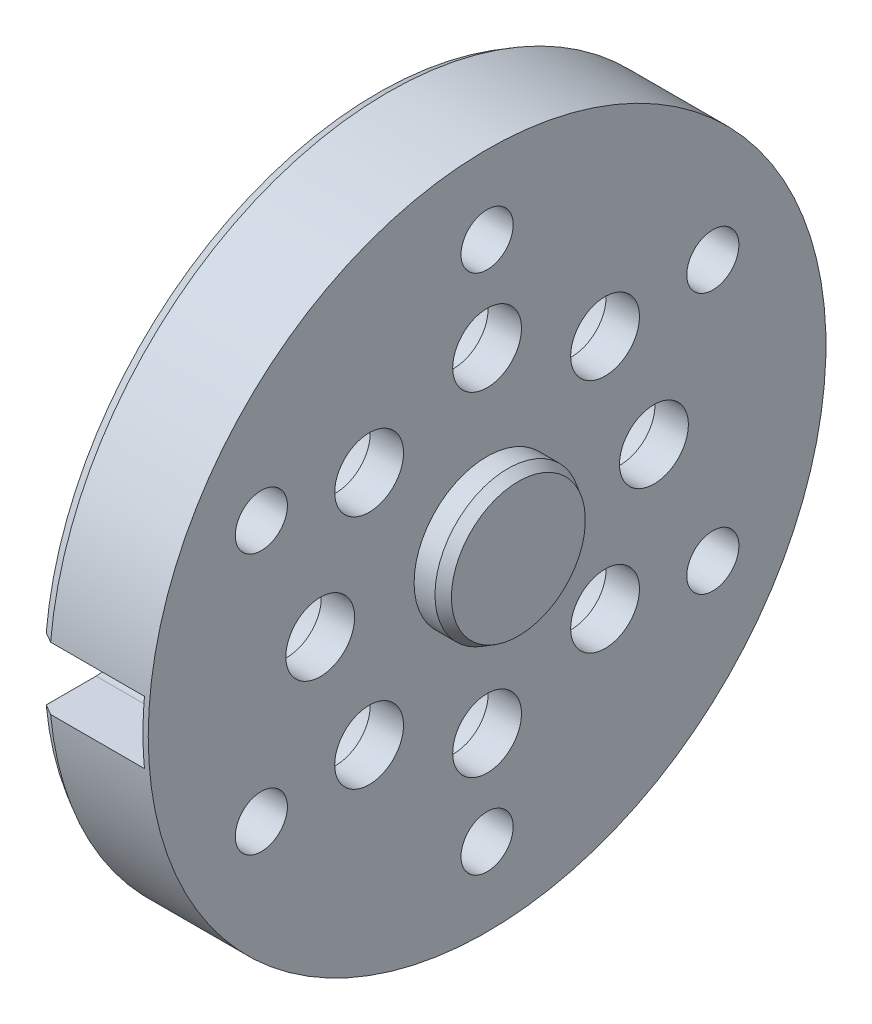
ISO-10303-21;
HEADER;
FILE_DESCRIPTION(('STEP AP214'),'2;1');
FILE_NAME('part.step','',(''),(''),'','','');
FILE_SCHEMA(('AUTOMOTIVE_DESIGN { 1 0 10303 214 1 1 1 1 }'));
ENDSEC;
DATA;
#1=APPLICATION_CONTEXT('core data for automotive mechanical design processes');
#2=APPLICATION_PROTOCOL_DEFINITION('international standard','automotive_design',2000,#1);
#3=PRODUCT_CONTEXT('',#1,'mechanical');
#4=PRODUCT('Part','Part','',(#3));
#5=PRODUCT_RELATED_PRODUCT_CATEGORY('part','',(#4));
#6=PRODUCT_DEFINITION_FORMATION('','',#4);
#7=PRODUCT_DEFINITION_CONTEXT('part definition',#1,'design');
#8=PRODUCT_DEFINITION('design','',#6,#7);
#9=PRODUCT_DEFINITION_SHAPE('','',#8);
#10=(LENGTH_UNIT() NAMED_UNIT(*) SI_UNIT(.MILLI.,.METRE.));
#11=(NAMED_UNIT(*) PLANE_ANGLE_UNIT() SI_UNIT($,.RADIAN.));
#12=(NAMED_UNIT(*) SI_UNIT($,.STERADIAN.) SOLID_ANGLE_UNIT());
#13=UNCERTAINTY_MEASURE_WITH_UNIT(LENGTH_MEASURE(1.E-05),#10,'distance_accuracy_value','');
#14=(GEOMETRIC_REPRESENTATION_CONTEXT(3) GLOBAL_UNCERTAINTY_ASSIGNED_CONTEXT((#13)) GLOBAL_UNIT_ASSIGNED_CONTEXT((#10,
#11,#12)) REPRESENTATION_CONTEXT('',''));
#15=CARTESIAN_POINT('',(0.,0.,0.));
#16=DIRECTION('',(0.,0.,1.));
#17=DIRECTION('',(1.,0.,0.));
#18=AXIS2_PLACEMENT_3D('',#15,#16,#17);
#19=CARTESIAN_POINT('',(0.,32.5,0.));
#20=DIRECTION('',(1.,0.,0.));
#21=DIRECTION('',(0.,0.,-1.));
#22=AXIS2_PLACEMENT_3D('',#19,#20,#21);
#23=PLANE('',#22);
#24=CARTESIAN_POINT('',(0.,-11.3137084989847,11.3137084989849));
#25=DIRECTION('',(-1.,0.,0.));
#26=DIRECTION('',(0.,0.,1.));
#27=AXIS2_PLACEMENT_3D('',#24,#25,#26);
#28=CIRCLE('',#27,5.5);
#29=CARTESIAN_POINT('',(0.,-11.3137084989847,16.8137084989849));
#30=VERTEX_POINT('',#29);
#31=EDGE_CURVE('E324',#30,#30,#28,.T.);
#32=ORIENTED_EDGE('',*,*,#31,.F.);
#33=EDGE_LOOP('',(#32));
#34=FACE_BOUND('',#33,.T.);
#35=CARTESIAN_POINT('',(0.,-16.,0.));
#36=DIRECTION('',(-1.,0.,0.));
#37=DIRECTION('',(0.,0.,1.));
#38=AXIS2_PLACEMENT_3D('',#35,#36,#37);
#39=CIRCLE('',#38,5.5);
#40=CARTESIAN_POINT('',(0.,-16.,5.5));
#41=VERTEX_POINT('',#40);
#42=EDGE_CURVE('E320',#41,#41,#39,.T.);
#43=ORIENTED_EDGE('',*,*,#42,.F.);
#44=EDGE_LOOP('',(#43));
#45=FACE_BOUND('',#44,.T.);
#46=CARTESIAN_POINT('',(0.,-11.3137084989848,-11.3137084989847));
#47=DIRECTION('',(-1.,0.,0.));
#48=DIRECTION('',(0.,0.,1.));
#49=AXIS2_PLACEMENT_3D('',#46,#47,#48);
#50=CIRCLE('',#49,5.5);
#51=CARTESIAN_POINT('',(0.,-11.3137084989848,-5.8137084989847));
#52=VERTEX_POINT('',#51);
#53=EDGE_CURVE('E316',#52,#52,#50,.T.);
#54=ORIENTED_EDGE('',*,*,#53,.F.);
#55=EDGE_LOOP('',(#54));
#56=FACE_BOUND('',#55,.T.);
#57=CARTESIAN_POINT('',(0.,0.,-16.));
#58=DIRECTION('',(-1.,0.,0.));
#59=DIRECTION('',(0.,0.,1.));
#60=AXIS2_PLACEMENT_3D('',#57,#58,#59);
#61=CIRCLE('',#60,5.5);
#62=CARTESIAN_POINT('',(0.,0.,-10.5));
#63=VERTEX_POINT('',#62);
#64=EDGE_CURVE('E311',#63,#63,#61,.T.);
#65=ORIENTED_EDGE('',*,*,#64,.F.);
#66=EDGE_LOOP('',(#65));
#67=FACE_BOUND('',#66,.T.);
#68=DIRECTION('',(0.,0.,-1.));
#69=VECTOR('',#68,1.);
#70=CARTESIAN_POINT('',(0.,3.,27.));
#71=LINE('',#70,#69);
#72=CARTESIAN_POINT('',(0.,3.,31.7813713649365));
#73=VERTEX_POINT('',#72);
#74=CARTESIAN_POINT('',(0.,3.,27.));
#75=VERTEX_POINT('',#74);
#76=EDGE_CURVE('E111',#73,#75,#71,.T.);
#77=ORIENTED_EDGE('',*,*,#76,.F.);
#78=CARTESIAN_POINT('',(0.,0.,0.));
#79=DIRECTION('',(1.,0.,0.));
#80=DIRECTION('',(0.,0.,-1.));
#81=AXIS2_PLACEMENT_3D('',#78,#79,#80);
#82=CIRCLE('',#81,31.9226497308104);
#83=CARTESIAN_POINT('',(0.,-3.,31.7813713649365));
#84=VERTEX_POINT('',#83);
#85=EDGE_CURVE('E195',#73,#84,#82,.F.);
#86=ORIENTED_EDGE('',*,*,#85,.T.);
#87=DIRECTION('',(0.,0.,1.));
#88=VECTOR('',#87,1.);
#89=CARTESIAN_POINT('',(0.,-3.,27.));
#90=LINE('',#89,#88);
#91=CARTESIAN_POINT('',(0.,-3.,27.));
#92=VERTEX_POINT('',#91);
#93=EDGE_CURVE('E113',#92,#84,#90,.T.);
#94=ORIENTED_EDGE('',*,*,#93,.F.);
#95=CARTESIAN_POINT('',(0.,0.,27.));
#96=DIRECTION('',(-1.,0.,0.));
#97=DIRECTION('',(0.,0.,1.));
#98=AXIS2_PLACEMENT_3D('',#95,#96,#97);
#99=CIRCLE('',#98,3.);
#100=EDGE_CURVE('E96',#75,#92,#99,.T.);
#101=ORIENTED_EDGE('',*,*,#100,.F.);
#102=EDGE_LOOP('',(#77,#86,#94,#101));
#103=FACE_BOUND('',#102,.T.);
#104=CARTESIAN_POINT('',(0.,12.5,-21.650635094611));
#105=DIRECTION('',(-1.,0.,0.));
#106=DIRECTION('',(0.,0.,1.));
#107=AXIS2_PLACEMENT_3D('',#104,#105,#106);
#108=CIRCLE('',#107,2.5);
#109=CARTESIAN_POINT('',(0.,12.5,-19.150635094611));
#110=VERTEX_POINT('',#109);
#111=EDGE_CURVE('E164',#110,#110,#108,.T.);
#112=ORIENTED_EDGE('',*,*,#111,.F.);
#113=EDGE_LOOP('',(#112));
#114=FACE_BOUND('',#113,.T.);
#115=CARTESIAN_POINT('',(0.,-12.5,-21.650635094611));
#116=DIRECTION('',(-1.,0.,0.));
#117=DIRECTION('',(0.,0.,1.));
#118=AXIS2_PLACEMENT_3D('',#115,#116,#117);
#119=CIRCLE('',#118,2.5);
#120=CARTESIAN_POINT('',(0.,-12.5,-19.150635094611));
#121=VERTEX_POINT('',#120);
#122=EDGE_CURVE('E160',#121,#121,#119,.T.);
#123=ORIENTED_EDGE('',*,*,#122,.F.);
#124=EDGE_LOOP('',(#123));
#125=FACE_BOUND('',#124,.T.);
#126=CARTESIAN_POINT('',(0.,-25.,0.));
#127=DIRECTION('',(-1.,0.,0.));
#128=DIRECTION('',(0.,0.,1.));
#129=AXIS2_PLACEMENT_3D('',#126,#127,#128);
#130=CIRCLE('',#129,2.5);
#131=CARTESIAN_POINT('',(0.,-25.,2.5));
#132=VERTEX_POINT('',#131);
#133=EDGE_CURVE('E154',#132,#132,#130,.T.);
#134=ORIENTED_EDGE('',*,*,#133,.F.);
#135=EDGE_LOOP('',(#134));
#136=FACE_BOUND('',#135,.T.);
#137=CARTESIAN_POINT('',(0.,-12.5,21.650635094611));
#138=DIRECTION('',(-1.,0.,0.));
#139=DIRECTION('',(0.,0.,1.));
#140=AXIS2_PLACEMENT_3D('',#137,#138,#139);
#141=CIRCLE('',#140,2.5);
#142=CARTESIAN_POINT('',(0.,-12.5,24.150635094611));
#143=VERTEX_POINT('',#142);
#144=EDGE_CURVE('E150',#143,#143,#141,.T.);
#145=ORIENTED_EDGE('',*,*,#144,.F.);
#146=EDGE_LOOP('',(#145));
#147=FACE_BOUND('',#146,.T.);
#148=CARTESIAN_POINT('',(0.,12.5,21.650635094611));
#149=DIRECTION('',(-1.,0.,0.));
#150=DIRECTION('',(0.,0.,1.));
#151=AXIS2_PLACEMENT_3D('',#148,#149,#150);
#152=CIRCLE('',#151,2.5);
#153=CARTESIAN_POINT('',(0.,12.5,24.150635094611));
#154=VERTEX_POINT('',#153);
#155=EDGE_CURVE('E146',#154,#154,#152,.T.);
#156=ORIENTED_EDGE('',*,*,#155,.F.);
#157=EDGE_LOOP('',(#156));
#158=FACE_BOUND('',#157,.T.);
#159=CARTESIAN_POINT('',(0.,25.,0.));
#160=DIRECTION('',(-1.,0.,0.));
#161=DIRECTION('',(0.,0.,1.));
#162=AXIS2_PLACEMENT_3D('',#159,#160,#161);
#163=CIRCLE('',#162,2.5);
#164=CARTESIAN_POINT('',(0.,25.,2.5));
#165=VERTEX_POINT('',#164);
#166=EDGE_CURVE('E140',#165,#165,#163,.T.);
#167=ORIENTED_EDGE('',*,*,#166,.F.);
#168=EDGE_LOOP('',(#167));
#169=FACE_BOUND('',#168,.T.);
#170=CARTESIAN_POINT('',(0.,0.,-25.));
#171=DIRECTION('',(-1.,0.,0.));
#172=DIRECTION('',(0.,0.,1.));
#173=AXIS2_PLACEMENT_3D('',#170,#171,#172);
#174=CIRCLE('',#173,1.99999999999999);
#175=CARTESIAN_POINT('',(0.,0.,-23.));
#176=VERTEX_POINT('',#175);
#177=EDGE_CURVE('E134',#176,#176,#174,.T.);
#178=ORIENTED_EDGE('',*,*,#177,.F.);
#179=EDGE_LOOP('',(#178));
#180=FACE_BOUND('',#179,.T.);
#181=CARTESIAN_POINT('',(0.,16.,0.));
#182=DIRECTION('',(-1.,0.,0.));
#183=DIRECTION('',(0.,0.,1.));
#184=AXIS2_PLACEMENT_3D('',#181,#182,#183);
#185=CIRCLE('',#184,5.5);
#186=CARTESIAN_POINT('',(0.,16.,5.5));
#187=VERTEX_POINT('',#186);
#188=EDGE_CURVE('E123',#187,#187,#185,.T.);
#189=ORIENTED_EDGE('',*,*,#188,.F.);
#190=EDGE_LOOP('',(#189));
#191=FACE_BOUND('',#190,.T.);
#192=CARTESIAN_POINT('',(0.,0.,0.));
#193=DIRECTION('',(1.,0.,0.));
#194=DIRECTION('',(0.,0.,-1.));
#195=AXIS2_PLACEMENT_3D('',#192,#193,#194);
#196=CIRCLE('',#195,9.57735026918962);
#197=CARTESIAN_POINT('',(0.,0.,-9.57735026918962));
#198=VERTEX_POINT('',#197);
#199=EDGE_CURVE('E192',#198,#198,#196,.T.);
#200=ORIENTED_EDGE('',*,*,#199,.T.);
#201=EDGE_LOOP('',(#200));
#202=FACE_BOUND('',#201,.T.);
#203=CARTESIAN_POINT('',(0.,11.3137084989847,-11.3137084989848));
#204=DIRECTION('',(-1.,0.,0.));
#205=DIRECTION('',(0.,0.,1.));
#206=AXIS2_PLACEMENT_3D('',#203,#204,#205);
#207=CIRCLE('',#206,5.5);
#208=CARTESIAN_POINT('',(0.,11.3137084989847,-5.81370849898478));
#209=VERTEX_POINT('',#208);
#210=EDGE_CURVE('E306',#209,#209,#207,.T.);
#211=ORIENTED_EDGE('',*,*,#210,.F.);
#212=EDGE_LOOP('',(#211));
#213=FACE_BOUND('',#212,.T.);
#214=CARTESIAN_POINT('',(0.,1.6759110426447E-13,16.));
#215=DIRECTION('',(-1.,0.,0.));
#216=DIRECTION('',(0.,0.,1.));
#217=AXIS2_PLACEMENT_3D('',#214,#215,#216);
#218=CIRCLE('',#217,5.5);
#219=CARTESIAN_POINT('',(0.,1.6759110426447E-13,21.5));
#220=VERTEX_POINT('',#219);
#221=EDGE_CURVE('E337',#220,#220,#218,.T.);
#222=ORIENTED_EDGE('',*,*,#221,.F.);
#223=EDGE_LOOP('',(#222));
#224=FACE_BOUND('',#223,.T.);
#225=CARTESIAN_POINT('',(0.,11.3137084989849,11.3137084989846));
#226=DIRECTION('',(-1.,0.,0.));
#227=DIRECTION('',(0.,0.,1.));
#228=AXIS2_PLACEMENT_3D('',#225,#226,#227);
#229=CIRCLE('',#228,5.5);
#230=CARTESIAN_POINT('',(0.,11.3137084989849,16.8137084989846));
#231=VERTEX_POINT('',#230);
#232=EDGE_CURVE('E628',#231,#231,#229,.T.);
#233=ORIENTED_EDGE('',*,*,#232,.F.);
#234=EDGE_LOOP('',(#233));
#235=FACE_BOUND('',#234,.T.);
#236=ADVANCED_FACE('F36',(#34,#45,#56,#67,#103,#114,#125,#136,#147,#158,#169,#180,#191,#202,
#213,#224,#235),#23,.F.);
#237=CARTESIAN_POINT('',(0.,0.,0.));
#238=DIRECTION('',(-1.,0.,0.));
#239=DIRECTION('',(0.,0.,1.));
#240=AXIS2_PLACEMENT_3D('',#237,#238,#239);
#241=CYLINDRICAL_SURFACE('',#240,9.);
#242=CARTESIAN_POINT('',(0.999999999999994,0.,0.));
#243=DIRECTION('',(1.,0.,0.));
#244=DIRECTION('',(0.,0.,-1.));
#245=AXIS2_PLACEMENT_3D('',#242,#243,#244);
#246=CIRCLE('',#245,9.);
#247=CARTESIAN_POINT('',(0.999999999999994,0.,-9.));
#248=VERTEX_POINT('',#247);
#249=EDGE_CURVE('E290',#248,#248,#246,.F.);
#250=ORIENTED_EDGE('',*,*,#249,.T.);
#251=EDGE_LOOP('',(#250));
#252=FACE_BOUND('',#251,.T.);
#253=CARTESIAN_POINT('',(6.,0.,0.));
#254=DIRECTION('',(-1.,0.,0.));
#255=DIRECTION('',(0.,0.,1.));
#256=AXIS2_PLACEMENT_3D('',#253,#254,#255);
#257=CIRCLE('',#256,9.);
#258=CARTESIAN_POINT('',(6.,0.,9.));
#259=VERTEX_POINT('',#258);
#260=EDGE_CURVE('E170',#259,#259,#257,.T.);
#261=ORIENTED_EDGE('',*,*,#260,.F.);
#262=EDGE_LOOP('',(#261));
#263=FACE_BOUND('',#262,.T.);
#264=ADVANCED_FACE('F280',(#252,#263),#241,.F.);
#265=CARTESIAN_POINT('',(0.,0.,0.));
#266=DIRECTION('',(-1.,0.,0.));
#267=DIRECTION('',(0.,0.,1.));
#268=AXIS2_PLACEMENT_3D('',#265,#266,#267);
#269=CYLINDRICAL_SURFACE('',#268,32.5);
#270=DIRECTION('',(-1.,0.,0.));
#271=VECTOR('',#270,1.);
#272=CARTESIAN_POINT('',(0.,-3.,32.3612422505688));
#273=LINE('',#272,#271);
#274=CARTESIAN_POINT('',(10.,-3.,32.3612422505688));
#275=VERTEX_POINT('',#274);
#276=CARTESIAN_POINT('',(1.00000000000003,-3.,32.3612422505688));
#277=VERTEX_POINT('',#276);
#278=EDGE_CURVE('E103',#275,#277,#273,.T.);
#279=ORIENTED_EDGE('',*,*,#278,.T.);
#280=CARTESIAN_POINT('',(1.00000000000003,0.,0.));
#281=DIRECTION('',(1.,0.,0.));
#282=DIRECTION('',(0.,0.,-1.));
#283=AXIS2_PLACEMENT_3D('',#280,#281,#282);
#284=CIRCLE('',#283,32.5);
#285=CARTESIAN_POINT('',(1.00000000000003,3.,32.3612422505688));
#286=VERTEX_POINT('',#285);
#287=EDGE_CURVE('E53',#277,#286,#284,.T.);
#288=ORIENTED_EDGE('',*,*,#287,.T.);
#289=DIRECTION('',(-1.,0.,0.));
#290=VECTOR('',#289,1.);
#291=CARTESIAN_POINT('',(0.,3.,32.3612422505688));
#292=LINE('',#291,#290);
#293=CARTESIAN_POINT('',(10.,3.,32.3612422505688));
#294=VERTEX_POINT('',#293);
#295=EDGE_CURVE('E190',#286,#294,#292,.F.);
#296=ORIENTED_EDGE('',*,*,#295,.T.);
#297=CARTESIAN_POINT('',(10.,0.,0.));
#298=DIRECTION('',(-1.,0.,0.));
#299=DIRECTION('',(0.,0.,1.));
#300=AXIS2_PLACEMENT_3D('',#297,#298,#299);
#301=CIRCLE('',#300,32.5);
#302=EDGE_CURVE('E179',#275,#294,#301,.T.);
#303=ORIENTED_EDGE('',*,*,#302,.F.);
#304=EDGE_LOOP('',(#279,#288,#296,#303));
#305=FACE_BOUND('',#304,.T.);
#306=CARTESIAN_POINT('',(10.5,0.,0.));
#307=DIRECTION('',(-1.,0.,0.));
#308=DIRECTION('',(0.,0.,1.));
#309=AXIS2_PLACEMENT_3D('',#306,#307,#308);
#310=CIRCLE('',#309,32.5);
#311=CARTESIAN_POINT('',(10.5,0.,32.5));
#312=VERTEX_POINT('',#311);
#313=EDGE_CURVE('E176',#312,#312,#310,.T.);
#314=ORIENTED_EDGE('',*,*,#313,.T.);
#315=EDGE_LOOP('',(#314));
#316=FACE_BOUND('',#315,.T.);
#317=ADVANCED_FACE('F276',(#305,#316),#269,.T.);
#318=CARTESIAN_POINT('',(10.5,7.,0.));
#319=DIRECTION('',(-1.,0.,0.));
#320=DIRECTION('',(0.,0.,1.));
#321=AXIS2_PLACEMENT_3D('',#318,#319,#320);
#322=PLANE('',#321);
#323=CARTESIAN_POINT('',(10.5,11.3137084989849,11.3137084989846));
#324=DIRECTION('',(-1.,0.,0.));
#325=DIRECTION('',(0.,0.,1.));
#326=AXIS2_PLACEMENT_3D('',#323,#324,#325);
#327=CIRCLE('',#326,3.3);
#328=CARTESIAN_POINT('',(10.5,11.3137084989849,14.6137084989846));
#329=VERTEX_POINT('',#328);
#330=EDGE_CURVE('E40',#329,#329,#327,.T.);
#331=ORIENTED_EDGE('',*,*,#330,.T.);
#332=EDGE_LOOP('',(#331));
#333=FACE_BOUND('',#332,.T.);
#334=CARTESIAN_POINT('',(10.5,1.6759110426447E-13,16.));
#335=DIRECTION('',(-1.,0.,0.));
#336=DIRECTION('',(0.,0.,1.));
#337=AXIS2_PLACEMENT_3D('',#334,#335,#336);
#338=CIRCLE('',#337,3.3);
#339=CARTESIAN_POINT('',(10.5,1.6759110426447E-13,19.3));
#340=VERTEX_POINT('',#339);
#341=EDGE_CURVE('E322',#340,#340,#338,.T.);
#342=ORIENTED_EDGE('',*,*,#341,.T.);
#343=EDGE_LOOP('',(#342));
#344=FACE_BOUND('',#343,.T.);
#345=CARTESIAN_POINT('',(10.5,-11.3137084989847,11.3137084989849));
#346=DIRECTION('',(-1.,0.,0.));
#347=DIRECTION('',(0.,0.,1.));
#348=AXIS2_PLACEMENT_3D('',#345,#346,#347);
#349=CIRCLE('',#348,3.3);
#350=CARTESIAN_POINT('',(10.5,-11.3137084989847,14.6137084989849));
#351=VERTEX_POINT('',#350);
#352=EDGE_CURVE('E318',#351,#351,#349,.T.);
#353=ORIENTED_EDGE('',*,*,#352,.T.);
#354=EDGE_LOOP('',(#353));
#355=FACE_BOUND('',#354,.T.);
#356=CARTESIAN_POINT('',(10.5,-16.,0.));
#357=DIRECTION('',(-1.,0.,0.));
#358=DIRECTION('',(0.,0.,1.));
#359=AXIS2_PLACEMENT_3D('',#356,#357,#358);
#360=CIRCLE('',#359,3.3);
#361=CARTESIAN_POINT('',(10.5,-16.,3.3));
#362=VERTEX_POINT('',#361);
#363=EDGE_CURVE('E313',#362,#362,#360,.T.);
#364=ORIENTED_EDGE('',*,*,#363,.T.);
#365=EDGE_LOOP('',(#364));
#366=FACE_BOUND('',#365,.T.);
#367=CARTESIAN_POINT('',(10.5,-11.3137084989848,-11.3137084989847));
#368=DIRECTION('',(-1.,0.,0.));
#369=DIRECTION('',(0.,0.,1.));
#370=AXIS2_PLACEMENT_3D('',#367,#368,#369);
#371=CIRCLE('',#370,3.3);
#372=CARTESIAN_POINT('',(10.5,-11.3137084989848,-8.0137084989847));
#373=VERTEX_POINT('',#372);
#374=EDGE_CURVE('E308',#373,#373,#371,.T.);
#375=ORIENTED_EDGE('',*,*,#374,.T.);
#376=EDGE_LOOP('',(#375));
#377=FACE_BOUND('',#376,.T.);
#378=CARTESIAN_POINT('',(10.5,0.,-16.));
#379=DIRECTION('',(-1.,0.,0.));
#380=DIRECTION('',(0.,0.,1.));
#381=AXIS2_PLACEMENT_3D('',#378,#379,#380);
#382=CIRCLE('',#381,3.3);
#383=CARTESIAN_POINT('',(10.5,0.,-12.7));
#384=VERTEX_POINT('',#383);
#385=EDGE_CURVE('E303',#384,#384,#382,.T.);
#386=ORIENTED_EDGE('',*,*,#385,.T.);
#387=EDGE_LOOP('',(#386));
#388=FACE_BOUND('',#387,.T.);
#389=CARTESIAN_POINT('',(10.5,11.3137084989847,-11.3137084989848));
#390=DIRECTION('',(-1.,0.,0.));
#391=DIRECTION('',(0.,0.,1.));
#392=AXIS2_PLACEMENT_3D('',#389,#390,#391);
#393=CIRCLE('',#392,3.3);
#394=CARTESIAN_POINT('',(10.5,11.3137084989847,-8.01370849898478));
#395=VERTEX_POINT('',#394);
#396=EDGE_CURVE('E121',#395,#395,#393,.T.);
#397=ORIENTED_EDGE('',*,*,#396,.T.);
#398=EDGE_LOOP('',(#397));
#399=FACE_BOUND('',#398,.T.);
#400=CARTESIAN_POINT('',(10.5,16.,0.));
#401=DIRECTION('',(-1.,0.,0.));
#402=DIRECTION('',(0.,0.,1.));
#403=AXIS2_PLACEMENT_3D('',#400,#401,#402);
#404=CIRCLE('',#403,3.3);
#405=CARTESIAN_POINT('',(10.5,16.,3.3));
#406=VERTEX_POINT('',#405);
#407=EDGE_CURVE('E133',#406,#406,#404,.T.);
#408=ORIENTED_EDGE('',*,*,#407,.T.);
#409=EDGE_LOOP('',(#408));
#410=FACE_BOUND('',#409,.T.);
#411=CARTESIAN_POINT('',(10.5,25.,0.));
#412=DIRECTION('',(-1.,0.,0.));
#413=DIRECTION('',(0.,0.,1.));
#414=AXIS2_PLACEMENT_3D('',#411,#412,#413);
#415=CIRCLE('',#414,2.5);
#416=CARTESIAN_POINT('',(10.5,25.,2.5));
#417=VERTEX_POINT('',#416);
#418=EDGE_CURVE('E143',#417,#417,#415,.T.);
#419=ORIENTED_EDGE('',*,*,#418,.T.);
#420=EDGE_LOOP('',(#419));
#421=FACE_BOUND('',#420,.T.);
#422=CARTESIAN_POINT('',(10.5,12.5,21.650635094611));
#423=DIRECTION('',(-1.,0.,0.));
#424=DIRECTION('',(0.,0.,1.));
#425=AXIS2_PLACEMENT_3D('',#422,#423,#424);
#426=CIRCLE('',#425,2.5);
#427=CARTESIAN_POINT('',(10.5,12.5,24.150635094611));
#428=VERTEX_POINT('',#427);
#429=EDGE_CURVE('E149',#428,#428,#426,.T.);
#430=ORIENTED_EDGE('',*,*,#429,.T.);
#431=EDGE_LOOP('',(#430));
#432=FACE_BOUND('',#431,.T.);
#433=CARTESIAN_POINT('',(10.5,-12.5,21.650635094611));
#434=DIRECTION('',(-1.,0.,0.));
#435=DIRECTION('',(0.,0.,1.));
#436=AXIS2_PLACEMENT_3D('',#433,#434,#435);
#437=CIRCLE('',#436,2.5);
#438=CARTESIAN_POINT('',(10.5,-12.5,24.150635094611));
#439=VERTEX_POINT('',#438);
#440=EDGE_CURVE('E153',#439,#439,#437,.T.);
#441=ORIENTED_EDGE('',*,*,#440,.T.);
#442=EDGE_LOOP('',(#441));
#443=FACE_BOUND('',#442,.T.);
#444=CARTESIAN_POINT('',(10.5,-25.,0.));
#445=DIRECTION('',(-1.,0.,0.));
#446=DIRECTION('',(0.,0.,1.));
#447=AXIS2_PLACEMENT_3D('',#444,#445,#446);
#448=CIRCLE('',#447,2.5);
#449=CARTESIAN_POINT('',(10.5,-25.,2.5));
#450=VERTEX_POINT('',#449);
#451=EDGE_CURVE('E157',#450,#450,#448,.T.);
#452=ORIENTED_EDGE('',*,*,#451,.T.);
#453=EDGE_LOOP('',(#452));
#454=FACE_BOUND('',#453,.T.);
#455=CARTESIAN_POINT('',(10.5,-12.5,-21.650635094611));
#456=DIRECTION('',(-1.,0.,0.));
#457=DIRECTION('',(0.,0.,1.));
#458=AXIS2_PLACEMENT_3D('',#455,#456,#457);
#459=CIRCLE('',#458,2.5);
#460=CARTESIAN_POINT('',(10.5,-12.5,-19.150635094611));
#461=VERTEX_POINT('',#460);
#462=EDGE_CURVE('E163',#461,#461,#459,.T.);
#463=ORIENTED_EDGE('',*,*,#462,.T.);
#464=EDGE_LOOP('',(#463));
#465=FACE_BOUND('',#464,.T.);
#466=CARTESIAN_POINT('',(10.5,12.5,-21.650635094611));
#467=DIRECTION('',(-1.,0.,0.));
#468=DIRECTION('',(0.,0.,1.));
#469=AXIS2_PLACEMENT_3D('',#466,#467,#468);
#470=CIRCLE('',#469,2.5);
#471=CARTESIAN_POINT('',(10.5,12.5,-19.150635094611));
#472=VERTEX_POINT('',#471);
#473=EDGE_CURVE('E167',#472,#472,#470,.T.);
#474=ORIENTED_EDGE('',*,*,#473,.T.);
#475=EDGE_LOOP('',(#474));
#476=FACE_BOUND('',#475,.T.);
#477=ORIENTED_EDGE('',*,*,#313,.F.);
#478=EDGE_LOOP('',(#477));
#479=FACE_BOUND('',#478,.T.);
#480=CARTESIAN_POINT('',(10.5,0.,0.));
#481=DIRECTION('',(-1.,0.,0.));
#482=DIRECTION('',(0.,0.,1.));
#483=AXIS2_PLACEMENT_3D('',#480,#481,#482);
#484=CIRCLE('',#483,7.);
#485=CARTESIAN_POINT('',(10.5,0.,7.));
#486=VERTEX_POINT('',#485);
#487=EDGE_CURVE('E173',#486,#486,#484,.T.);
#488=ORIENTED_EDGE('',*,*,#487,.T.);
#489=EDGE_LOOP('',(#488));
#490=FACE_BOUND('',#489,.T.);
#491=ADVANCED_FACE('F272',(#333,#344,#355,#366,#377,#388,#399,#410,#421,#432,#443,#454,#465,
#476,#479,#490),#322,.F.);
#492=CARTESIAN_POINT('',(0.,0.,0.));
#493=DIRECTION('',(-1.,0.,0.));
#494=DIRECTION('',(0.,0.,1.));
#495=AXIS2_PLACEMENT_3D('',#492,#493,#494);
#496=CYLINDRICAL_SURFACE('',#495,7.);
#497=CARTESIAN_POINT('',(12.5,0.,0.));
#498=DIRECTION('',(-1.,0.,0.));
#499=DIRECTION('',(0.,0.,1.));
#500=AXIS2_PLACEMENT_3D('',#497,#498,#499);
#501=CIRCLE('',#500,7.);
#502=CARTESIAN_POINT('',(12.5,0.,7.));
#503=VERTEX_POINT('',#502);
#504=EDGE_CURVE('E45',#503,#503,#501,.T.);
#505=ORIENTED_EDGE('',*,*,#504,.T.);
#506=EDGE_LOOP('',(#505));
#507=FACE_BOUND('',#506,.T.);
#508=ORIENTED_EDGE('',*,*,#487,.F.);
#509=EDGE_LOOP('',(#508));
#510=FACE_BOUND('',#509,.T.);
#511=ADVANCED_FACE('F268',(#507,#510),#496,.T.);
#512=CARTESIAN_POINT('',(13.5,7.,0.));
#513=DIRECTION('',(-1.,0.,0.));
#514=DIRECTION('',(0.,0.,1.));
#515=AXIS2_PLACEMENT_3D('',#512,#513,#514);
#516=PLANE('',#515);
#517=CARTESIAN_POINT('',(13.5,0.,0.));
#518=DIRECTION('',(-1.,0.,0.));
#519=DIRECTION('',(0.,0.,1.));
#520=AXIS2_PLACEMENT_3D('',#517,#518,#519);
#521=CIRCLE('',#520,6.42264973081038);
#522=CARTESIAN_POINT('',(13.5,0.,6.42264973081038));
#523=VERTEX_POINT('',#522);
#524=EDGE_CURVE('E11',#523,#523,#521,.F.);
#525=ORIENTED_EDGE('',*,*,#524,.T.);
#526=EDGE_LOOP('',(#525));
#527=FACE_BOUND('',#526,.T.);
#528=ADVANCED_FACE('F264',(#527),#516,.F.);
#529=CARTESIAN_POINT('',(6.,9.,0.));
#530=DIRECTION('',(1.,0.,0.));
#531=DIRECTION('',(0.,0.,-1.));
#532=AXIS2_PLACEMENT_3D('',#529,#530,#531);
#533=PLANE('',#532);
#534=ORIENTED_EDGE('',*,*,#260,.T.);
#535=EDGE_LOOP('',(#534));
#536=FACE_BOUND('',#535,.T.);
#537=ADVANCED_FACE('F260',(#536),#533,.F.);
#538=CARTESIAN_POINT('',(0.,12.5,-21.650635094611));
#539=DIRECTION('',(-1.,0.,0.));
#540=DIRECTION('',(0.,0.,1.));
#541=AXIS2_PLACEMENT_3D('',#538,#539,#540);
#542=CYLINDRICAL_SURFACE('',#541,2.5);
#543=ORIENTED_EDGE('',*,*,#111,.T.);
#544=EDGE_LOOP('',(#543));
#545=FACE_BOUND('',#544,.T.);
#546=ORIENTED_EDGE('',*,*,#473,.F.);
#547=EDGE_LOOP('',(#546));
#548=FACE_BOUND('',#547,.T.);
#549=ADVANCED_FACE('F256',(#545,#548),#542,.F.);
#550=CARTESIAN_POINT('',(0.,-12.5,-21.650635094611));
#551=DIRECTION('',(-1.,0.,0.));
#552=DIRECTION('',(0.,0.,1.));
#553=AXIS2_PLACEMENT_3D('',#550,#551,#552);
#554=CYLINDRICAL_SURFACE('',#553,2.5);
#555=ORIENTED_EDGE('',*,*,#122,.T.);
#556=EDGE_LOOP('',(#555));
#557=FACE_BOUND('',#556,.T.);
#558=ORIENTED_EDGE('',*,*,#462,.F.);
#559=EDGE_LOOP('',(#558));
#560=FACE_BOUND('',#559,.T.);
#561=ADVANCED_FACE('F252',(#557,#560),#554,.F.);
#562=CARTESIAN_POINT('',(0.,-25.,0.));
#563=DIRECTION('',(-1.,0.,0.));
#564=DIRECTION('',(0.,0.,1.));
#565=AXIS2_PLACEMENT_3D('',#562,#563,#564);
#566=CYLINDRICAL_SURFACE('',#565,2.5);
#567=ORIENTED_EDGE('',*,*,#133,.T.);
#568=EDGE_LOOP('',(#567));
#569=FACE_BOUND('',#568,.T.);
#570=ORIENTED_EDGE('',*,*,#451,.F.);
#571=EDGE_LOOP('',(#570));
#572=FACE_BOUND('',#571,.T.);
#573=ADVANCED_FACE('F248',(#569,#572),#566,.F.);
#574=CARTESIAN_POINT('',(0.,-12.5,21.650635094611));
#575=DIRECTION('',(-1.,0.,0.));
#576=DIRECTION('',(0.,0.,1.));
#577=AXIS2_PLACEMENT_3D('',#574,#575,#576);
#578=CYLINDRICAL_SURFACE('',#577,2.5);
#579=ORIENTED_EDGE('',*,*,#144,.T.);
#580=EDGE_LOOP('',(#579));
#581=FACE_BOUND('',#580,.T.);
#582=ORIENTED_EDGE('',*,*,#440,.F.);
#583=EDGE_LOOP('',(#582));
#584=FACE_BOUND('',#583,.T.);
#585=ADVANCED_FACE('F244',(#581,#584),#578,.F.);
#586=CARTESIAN_POINT('',(0.,12.5,21.650635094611));
#587=DIRECTION('',(-1.,0.,0.));
#588=DIRECTION('',(0.,0.,1.));
#589=AXIS2_PLACEMENT_3D('',#586,#587,#588);
#590=CYLINDRICAL_SURFACE('',#589,2.5);
#591=ORIENTED_EDGE('',*,*,#155,.T.);
#592=EDGE_LOOP('',(#591));
#593=FACE_BOUND('',#592,.T.);
#594=ORIENTED_EDGE('',*,*,#429,.F.);
#595=EDGE_LOOP('',(#594));
#596=FACE_BOUND('',#595,.T.);
#597=ADVANCED_FACE('F240',(#593,#596),#590,.F.);
#598=CARTESIAN_POINT('',(0.,25.,0.));
#599=DIRECTION('',(-1.,0.,0.));
#600=DIRECTION('',(0.,0.,1.));
#601=AXIS2_PLACEMENT_3D('',#598,#599,#600);
#602=CYLINDRICAL_SURFACE('',#601,2.5);
#603=ORIENTED_EDGE('',*,*,#166,.T.);
#604=EDGE_LOOP('',(#603));
#605=FACE_BOUND('',#604,.T.);
#606=ORIENTED_EDGE('',*,*,#418,.F.);
#607=EDGE_LOOP('',(#606));
#608=FACE_BOUND('',#607,.T.);
#609=ADVANCED_FACE('F236',(#605,#608),#602,.F.);
#610=CARTESIAN_POINT('',(4.,0.,-25.));
#611=DIRECTION('',(-1.,0.,0.));
#612=DIRECTION('',(0.,0.,1.));
#613=AXIS2_PLACEMENT_3D('',#610,#611,#612);
#614=CONICAL_SURFACE('',#613,1.99999999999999,1.02974425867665);
#615=CARTESIAN_POINT('',(5.20172123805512,0.,-25.));
#616=VERTEX_POINT('',#615);
#617=VERTEX_LOOP('',#616);
#618=FACE_BOUND('',#617,.T.);
#619=CARTESIAN_POINT('',(4.,0.,-25.));
#620=DIRECTION('',(-1.,0.,0.));
#621=DIRECTION('',(0.,0.,1.));
#622=AXIS2_PLACEMENT_3D('',#619,#620,#621);
#623=CIRCLE('',#622,1.99999999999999);
#624=CARTESIAN_POINT('',(4.,0.,-23.));
#625=VERTEX_POINT('',#624);
#626=EDGE_CURVE('E137',#625,#625,#623,.T.);
#627=ORIENTED_EDGE('',*,*,#626,.T.);
#628=EDGE_LOOP('',(#627));
#629=FACE_BOUND('',#628,.T.);
#630=ADVANCED_FACE('F232',(#618,#629),#614,.F.);
#631=CARTESIAN_POINT('',(0.,0.,-25.));
#632=DIRECTION('',(-1.,0.,0.));
#633=DIRECTION('',(0.,0.,1.));
#634=AXIS2_PLACEMENT_3D('',#631,#632,#633);
#635=CYLINDRICAL_SURFACE('',#634,1.99999999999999);
#636=ORIENTED_EDGE('',*,*,#626,.F.);
#637=EDGE_LOOP('',(#636));
#638=FACE_BOUND('',#637,.T.);
#639=ORIENTED_EDGE('',*,*,#177,.T.);
#640=EDGE_LOOP('',(#639));
#641=FACE_BOUND('',#640,.T.);
#642=ADVANCED_FACE('F228',(#638,#641),#635,.F.);
#643=CARTESIAN_POINT('',(0.,16.,0.));
#644=DIRECTION('',(-1.,0.,0.));
#645=DIRECTION('',(0.,0.,1.));
#646=AXIS2_PLACEMENT_3D('',#643,#644,#645);
#647=CYLINDRICAL_SURFACE('',#646,3.3);
#648=CARTESIAN_POINT('',(7.3,16.,0.));
#649=DIRECTION('',(-1.,0.,0.));
#650=DIRECTION('',(0.,0.,1.));
#651=AXIS2_PLACEMENT_3D('',#648,#649,#650);
#652=CIRCLE('',#651,3.3);
#653=CARTESIAN_POINT('',(7.3,16.,3.3));
#654=VERTEX_POINT('',#653);
#655=EDGE_CURVE('E130',#654,#654,#652,.T.);
#656=ORIENTED_EDGE('',*,*,#655,.T.);
#657=EDGE_LOOP('',(#656));
#658=FACE_BOUND('',#657,.T.);
#659=ORIENTED_EDGE('',*,*,#407,.F.);
#660=EDGE_LOOP('',(#659));
#661=FACE_BOUND('',#660,.T.);
#662=ADVANCED_FACE('F224',(#658,#661),#647,.F.);
#663=CARTESIAN_POINT('',(7.3,19.3,0.));
#664=DIRECTION('',(1.,0.,0.));
#665=DIRECTION('',(0.,0.,-1.));
#666=AXIS2_PLACEMENT_3D('',#663,#664,#665);
#667=PLANE('',#666);
#668=ORIENTED_EDGE('',*,*,#655,.F.);
#669=EDGE_LOOP('',(#668));
#670=FACE_BOUND('',#669,.T.);
#671=CARTESIAN_POINT('',(7.3,16.,0.));
#672=DIRECTION('',(-1.,0.,0.));
#673=DIRECTION('',(0.,0.,1.));
#674=AXIS2_PLACEMENT_3D('',#671,#672,#673);
#675=CIRCLE('',#674,5.5);
#676=CARTESIAN_POINT('',(7.3,16.,5.5));
#677=VERTEX_POINT('',#676);
#678=EDGE_CURVE('E127',#677,#677,#675,.T.);
#679=ORIENTED_EDGE('',*,*,#678,.T.);
#680=EDGE_LOOP('',(#679));
#681=FACE_BOUND('',#680,.T.);
#682=ADVANCED_FACE('F220',(#670,#681),#667,.F.);
#683=CARTESIAN_POINT('',(0.,16.,0.));
#684=DIRECTION('',(-1.,0.,0.));
#685=DIRECTION('',(0.,0.,1.));
#686=AXIS2_PLACEMENT_3D('',#683,#684,#685);
#687=CYLINDRICAL_SURFACE('',#686,5.5);
#688=ORIENTED_EDGE('',*,*,#678,.F.);
#689=EDGE_LOOP('',(#688));
#690=FACE_BOUND('',#689,.T.);
#691=ORIENTED_EDGE('',*,*,#188,.T.);
#692=EDGE_LOOP('',(#691));
#693=FACE_BOUND('',#692,.T.);
#694=ADVANCED_FACE('F217',(#690,#693),#687,.F.);
#695=CARTESIAN_POINT('',(10.,3.,27.));
#696=DIRECTION('',(0.,1.,0.));
#697=DIRECTION('',(0.,0.,1.));
#698=AXIS2_PLACEMENT_3D('',#695,#696,#697);
#699=PLANE('',#698);
#700=ORIENTED_EDGE('',*,*,#295,.F.);
#701=CARTESIAN_POINT('',(1.00000000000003,3.,32.3612422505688));
#702=CARTESIAN_POINT('',(0.833330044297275,3.,32.2646027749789));
#703=CARTESIAN_POINT('',(0.666661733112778,3.,32.1679604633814));
#704=CARTESIAN_POINT('',(0.333328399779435,3.,31.9746701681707));
#705=CARTESIAN_POINT('',(0.16666337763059,3.,31.8780221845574));
#706=CARTESIAN_POINT('',(0.,3.,31.7813713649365));
#707=B_SPLINE_CURVE_WITH_KNOTS('',3,(#701,#702,#703,#704,#705,#706),.UNSPECIFIED.,.F.,.F.,(4,2,
4),(0.,0.577981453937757,1.15596290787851),.UNSPECIFIED.);
#708=EDGE_CURVE('E293',#286,#73,#707,.T.);
#709=ORIENTED_EDGE('',*,*,#708,.T.);
#710=ORIENTED_EDGE('',*,*,#76,.T.);
#711=DIRECTION('',(-1.,0.,0.));
#712=VECTOR('',#711,1.);
#713=CARTESIAN_POINT('',(10.,3.,27.));
#714=LINE('',#713,#712);
#715=CARTESIAN_POINT('',(10.,3.,27.));
#716=VERTEX_POINT('',#715);
#717=EDGE_CURVE('E98',#716,#75,#714,.T.);
#718=ORIENTED_EDGE('',*,*,#717,.F.);
#719=DIRECTION('',(0.,0.,-1.));
#720=VECTOR('',#719,1.);
#721=CARTESIAN_POINT('',(10.,3.,27.));
#722=LINE('',#721,#720);
#723=EDGE_CURVE('E99',#294,#716,#722,.T.);
#724=ORIENTED_EDGE('',*,*,#723,.F.);
#725=EDGE_LOOP('',(#700,#709,#710,#718,#724));
#726=FACE_BOUND('',#725,.T.);
#727=ADVANCED_FACE('F212',(#726),#699,.F.);
#728=CARTESIAN_POINT('',(10.,-3.,27.));
#729=DIRECTION('',(0.,-1.,0.));
#730=DIRECTION('',(0.,0.,-1.));
#731=AXIS2_PLACEMENT_3D('',#728,#729,#730);
#732=PLANE('',#731);
#733=ORIENTED_EDGE('',*,*,#93,.T.);
#734=CARTESIAN_POINT('',(0.,-3.,31.7813713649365));
#735=CARTESIAN_POINT('',(0.166663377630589,-3.,31.8780221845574));
#736=CARTESIAN_POINT('',(0.333328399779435,-3.,31.9746701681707));
#737=CARTESIAN_POINT('',(0.666661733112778,-3.,32.1679604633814));
#738=CARTESIAN_POINT('',(0.833330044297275,-3.,32.2646027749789));
#739=CARTESIAN_POINT('',(1.00000000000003,-3.,32.3612422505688));
#740=B_SPLINE_CURVE_WITH_KNOTS('',3,(#734,#735,#736,#737,#738,#739),.UNSPECIFIED.,.F.,.F.,(4,2,
4),(0.,0.577981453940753,1.15596290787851),.UNSPECIFIED.);
#741=EDGE_CURVE('E61',#84,#277,#740,.T.);
#742=ORIENTED_EDGE('',*,*,#741,.T.);
#743=ORIENTED_EDGE('',*,*,#278,.F.);
#744=DIRECTION('',(0.,0.,1.));
#745=VECTOR('',#744,1.);
#746=CARTESIAN_POINT('',(10.,-3.,27.));
#747=LINE('',#746,#745);
#748=CARTESIAN_POINT('',(10.,-3.,27.));
#749=VERTEX_POINT('',#748);
#750=EDGE_CURVE('E101',#749,#275,#747,.T.);
#751=ORIENTED_EDGE('',*,*,#750,.F.);
#752=DIRECTION('',(-1.,0.,0.));
#753=VECTOR('',#752,1.);
#754=CARTESIAN_POINT('',(10.,-3.,27.));
#755=LINE('',#754,#753);
#756=EDGE_CURVE('E89',#749,#92,#755,.T.);
#757=ORIENTED_EDGE('',*,*,#756,.T.);
#758=EDGE_LOOP('',(#733,#742,#743,#751,#757));
#759=FACE_BOUND('',#758,.T.);
#760=ADVANCED_FACE('F102',(#759),#732,.F.);
#761=CARTESIAN_POINT('',(10.,0.,27.));
#762=DIRECTION('',(-1.,0.,0.));
#763=DIRECTION('',(0.,0.,1.));
#764=AXIS2_PLACEMENT_3D('',#761,#762,#763);
#765=PLANE('',#764);
#766=ORIENTED_EDGE('',*,*,#302,.T.);
#767=ORIENTED_EDGE('',*,*,#723,.T.);
#768=CARTESIAN_POINT('',(10.,0.,27.));
#769=DIRECTION('',(-1.,0.,0.));
#770=DIRECTION('',(0.,0.,1.));
#771=AXIS2_PLACEMENT_3D('',#768,#769,#770);
#772=CIRCLE('',#771,3.);
#773=EDGE_CURVE('E94',#716,#749,#772,.T.);
#774=ORIENTED_EDGE('',*,*,#773,.T.);
#775=ORIENTED_EDGE('',*,*,#750,.T.);
#776=EDGE_LOOP('',(#766,#767,#774,#775));
#777=FACE_BOUND('',#776,.T.);
#778=ADVANCED_FACE('F108',(#777),#765,.T.);
#779=CARTESIAN_POINT('',(10.,0.,27.));
#780=DIRECTION('',(-1.,0.,0.));
#781=DIRECTION('',(0.,0.,1.));
#782=AXIS2_PLACEMENT_3D('',#779,#780,#781);
#783=CYLINDRICAL_SURFACE('',#782,3.);
#784=ORIENTED_EDGE('',*,*,#100,.T.);
#785=ORIENTED_EDGE('',*,*,#756,.F.);
#786=ORIENTED_EDGE('',*,*,#773,.F.);
#787=ORIENTED_EDGE('',*,*,#717,.T.);
#788=EDGE_LOOP('',(#784,#785,#786,#787));
#789=FACE_BOUND('',#788,.T.);
#790=ADVANCED_FACE('F91',(#789),#783,.F.);
#791=CARTESIAN_POINT('',(0.,0.,0.));
#792=DIRECTION('',(1.,0.,0.));
#793=DIRECTION('',(0.,0.,-1.));
#794=AXIS2_PLACEMENT_3D('',#791,#792,#793);
#795=CONICAL_SURFACE('',#794,31.9226497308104,0.523598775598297);
#796=ORIENTED_EDGE('',*,*,#708,.F.);
#797=ORIENTED_EDGE('',*,*,#287,.F.);
#798=ORIENTED_EDGE('',*,*,#741,.F.);
#799=ORIENTED_EDGE('',*,*,#85,.F.);
#800=EDGE_LOOP('',(#796,#797,#798,#799));
#801=FACE_BOUND('',#800,.T.);
#802=ADVANCED_FACE('F205',(#801),#795,.T.);
#803=CARTESIAN_POINT('',(0.999999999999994,0.,0.));
#804=DIRECTION('',(-1.,0.,0.));
#805=DIRECTION('',(0.,0.,1.));
#806=AXIS2_PLACEMENT_3D('',#803,#804,#805);
#807=CONICAL_SURFACE('',#806,9.,0.523598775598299);
#808=ORIENTED_EDGE('',*,*,#199,.F.);
#809=EDGE_LOOP('',(#808));
#810=FACE_BOUND('',#809,.T.);
#811=ORIENTED_EDGE('',*,*,#249,.F.);
#812=EDGE_LOOP('',(#811));
#813=FACE_BOUND('',#812,.T.);
#814=ADVANCED_FACE('F407',(#810,#813),#807,.F.);
#815=CARTESIAN_POINT('',(12.5,0.,0.));
#816=DIRECTION('',(-1.,0.,0.));
#817=DIRECTION('',(0.,0.,1.));
#818=AXIS2_PLACEMENT_3D('',#815,#816,#817);
#819=CONICAL_SURFACE('',#818,7.,0.523598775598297);
#820=ORIENTED_EDGE('',*,*,#524,.F.);
#821=EDGE_LOOP('',(#820));
#822=FACE_BOUND('',#821,.T.);
#823=ORIENTED_EDGE('',*,*,#504,.F.);
#824=EDGE_LOOP('',(#823));
#825=FACE_BOUND('',#824,.T.);
#826=ADVANCED_FACE('F38',(#822,#825),#819,.T.);
#827=CARTESIAN_POINT('',(0.,11.3137084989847,-11.3137084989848));
#828=DIRECTION('',(-1.,0.,0.));
#829=DIRECTION('',(0.,0.,1.));
#830=AXIS2_PLACEMENT_3D('',#827,#828,#829);
#831=CYLINDRICAL_SURFACE('',#830,3.3);
#832=CARTESIAN_POINT('',(7.3,11.3137084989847,-11.3137084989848));
#833=DIRECTION('',(-1.,0.,0.));
#834=DIRECTION('',(0.,0.,1.));
#835=AXIS2_PLACEMENT_3D('',#832,#833,#834);
#836=CIRCLE('',#835,3.3);
#837=CARTESIAN_POINT('',(7.3,11.3137084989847,-8.01370849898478));
#838=VERTEX_POINT('',#837);
#839=EDGE_CURVE('E116',#838,#838,#836,.T.);
#840=ORIENTED_EDGE('',*,*,#839,.T.);
#841=EDGE_LOOP('',(#840));
#842=FACE_BOUND('',#841,.T.);
#843=ORIENTED_EDGE('',*,*,#396,.F.);
#844=EDGE_LOOP('',(#843));
#845=FACE_BOUND('',#844,.T.);
#846=ADVANCED_FACE('F374',(#842,#845),#831,.F.);
#847=CARTESIAN_POINT('',(7.3,14.6137084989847,-11.3137084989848));
#848=DIRECTION('',(1.,0.,0.));
#849=DIRECTION('',(0.,0.,-1.));
#850=AXIS2_PLACEMENT_3D('',#847,#848,#849);
#851=PLANE('',#850);
#852=ORIENTED_EDGE('',*,*,#839,.F.);
#853=EDGE_LOOP('',(#852));
#854=FACE_BOUND('',#853,.T.);
#855=CARTESIAN_POINT('',(7.3,11.3137084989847,-11.3137084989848));
#856=DIRECTION('',(-1.,0.,0.));
#857=DIRECTION('',(0.,0.,1.));
#858=AXIS2_PLACEMENT_3D('',#855,#856,#857);
#859=CIRCLE('',#858,5.5);
#860=CARTESIAN_POINT('',(7.3,11.3137084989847,-5.81370849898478));
#861=VERTEX_POINT('',#860);
#862=EDGE_CURVE('E367',#861,#861,#859,.T.);
#863=ORIENTED_EDGE('',*,*,#862,.T.);
#864=EDGE_LOOP('',(#863));
#865=FACE_BOUND('',#864,.T.);
#866=ADVANCED_FACE('F377',(#854,#865),#851,.F.);
#867=CARTESIAN_POINT('',(0.,11.3137084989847,-11.3137084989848));
#868=DIRECTION('',(-1.,0.,0.));
#869=DIRECTION('',(0.,0.,1.));
#870=AXIS2_PLACEMENT_3D('',#867,#868,#869);
#871=CYLINDRICAL_SURFACE('',#870,5.5);
#872=ORIENTED_EDGE('',*,*,#862,.F.);
#873=EDGE_LOOP('',(#872));
#874=FACE_BOUND('',#873,.T.);
#875=ORIENTED_EDGE('',*,*,#210,.T.);
#876=EDGE_LOOP('',(#875));
#877=FACE_BOUND('',#876,.T.);
#878=ADVANCED_FACE('F379',(#874,#877),#871,.F.);
#879=CARTESIAN_POINT('',(0.,0.,-16.));
#880=DIRECTION('',(-1.,0.,0.));
#881=DIRECTION('',(0.,0.,1.));
#882=AXIS2_PLACEMENT_3D('',#879,#880,#881);
#883=CYLINDRICAL_SURFACE('',#882,3.3);
#884=CARTESIAN_POINT('',(7.3,0.,-16.));
#885=DIRECTION('',(-1.,0.,0.));
#886=DIRECTION('',(0.,0.,1.));
#887=AXIS2_PLACEMENT_3D('',#884,#885,#886);
#888=CIRCLE('',#887,3.3);
#889=CARTESIAN_POINT('',(7.3,0.,-12.7));
#890=VERTEX_POINT('',#889);
#891=EDGE_CURVE('E307',#890,#890,#888,.T.);
#892=ORIENTED_EDGE('',*,*,#891,.T.);
#893=EDGE_LOOP('',(#892));
#894=FACE_BOUND('',#893,.T.);
#895=ORIENTED_EDGE('',*,*,#385,.F.);
#896=EDGE_LOOP('',(#895));
#897=FACE_BOUND('',#896,.T.);
#898=ADVANCED_FACE('F385',(#894,#897),#883,.F.);
#899=CARTESIAN_POINT('',(7.3,3.29999999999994,-16.));
#900=DIRECTION('',(1.,0.,0.));
#901=DIRECTION('',(0.,0.,-1.));
#902=AXIS2_PLACEMENT_3D('',#899,#900,#901);
#903=PLANE('',#902);
#904=ORIENTED_EDGE('',*,*,#891,.F.);
#905=EDGE_LOOP('',(#904));
#906=FACE_BOUND('',#905,.T.);
#907=CARTESIAN_POINT('',(7.3,0.,-16.));
#908=DIRECTION('',(-1.,0.,0.));
#909=DIRECTION('',(0.,0.,1.));
#910=AXIS2_PLACEMENT_3D('',#907,#908,#909);
#911=CIRCLE('',#910,5.5);
#912=CARTESIAN_POINT('',(7.3,0.,-10.5));
#913=VERTEX_POINT('',#912);
#914=EDGE_CURVE('E361',#913,#913,#911,.T.);
#915=ORIENTED_EDGE('',*,*,#914,.T.);
#916=EDGE_LOOP('',(#915));
#917=FACE_BOUND('',#916,.T.);
#918=ADVANCED_FACE('F450',(#906,#917),#903,.F.);
#919=CARTESIAN_POINT('',(0.,0.,-16.));
#920=DIRECTION('',(-1.,0.,0.));
#921=DIRECTION('',(0.,0.,1.));
#922=AXIS2_PLACEMENT_3D('',#919,#920,#921);
#923=CYLINDRICAL_SURFACE('',#922,5.5);
#924=ORIENTED_EDGE('',*,*,#914,.F.);
#925=EDGE_LOOP('',(#924));
#926=FACE_BOUND('',#925,.T.);
#927=ORIENTED_EDGE('',*,*,#64,.T.);
#928=EDGE_LOOP('',(#927));
#929=FACE_BOUND('',#928,.T.);
#930=ADVANCED_FACE('F459',(#926,#929),#923,.F.);
#931=CARTESIAN_POINT('',(0.,-11.3137084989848,-11.3137084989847));
#932=DIRECTION('',(-1.,0.,0.));
#933=DIRECTION('',(0.,0.,1.));
#934=AXIS2_PLACEMENT_3D('',#931,#932,#933);
#935=CYLINDRICAL_SURFACE('',#934,3.3);
#936=CARTESIAN_POINT('',(7.3,-11.3137084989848,-11.3137084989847));
#937=DIRECTION('',(-1.,0.,0.));
#938=DIRECTION('',(0.,0.,1.));
#939=AXIS2_PLACEMENT_3D('',#936,#937,#938);
#940=CIRCLE('',#939,3.3);
#941=CARTESIAN_POINT('',(7.3,-11.3137084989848,-8.0137084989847));
#942=VERTEX_POINT('',#941);
#943=EDGE_CURVE('E312',#942,#942,#940,.T.);
#944=ORIENTED_EDGE('',*,*,#943,.T.);
#945=EDGE_LOOP('',(#944));
#946=FACE_BOUND('',#945,.T.);
#947=ORIENTED_EDGE('',*,*,#374,.F.);
#948=EDGE_LOOP('',(#947));
#949=FACE_BOUND('',#948,.T.);
#950=ADVANCED_FACE('F469',(#946,#949),#935,.F.);
#951=CARTESIAN_POINT('',(7.3,-8.01370849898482,-11.3137084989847));
#952=DIRECTION('',(1.,0.,0.));
#953=DIRECTION('',(0.,0.,-1.));
#954=AXIS2_PLACEMENT_3D('',#951,#952,#953);
#955=PLANE('',#954);
#956=ORIENTED_EDGE('',*,*,#943,.F.);
#957=EDGE_LOOP('',(#956));
#958=FACE_BOUND('',#957,.T.);
#959=CARTESIAN_POINT('',(7.3,-11.3137084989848,-11.3137084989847));
#960=DIRECTION('',(-1.,0.,0.));
#961=DIRECTION('',(0.,0.,1.));
#962=AXIS2_PLACEMENT_3D('',#959,#960,#961);
#963=CIRCLE('',#962,5.5);
#964=CARTESIAN_POINT('',(7.3,-11.3137084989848,-5.8137084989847));
#965=VERTEX_POINT('',#964);
#966=EDGE_CURVE('E354',#965,#965,#963,.T.);
#967=ORIENTED_EDGE('',*,*,#966,.T.);
#968=EDGE_LOOP('',(#967));
#969=FACE_BOUND('',#968,.T.);
#970=ADVANCED_FACE('F479',(#958,#969),#955,.F.);
#971=CARTESIAN_POINT('',(0.,-11.3137084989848,-11.3137084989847));
#972=DIRECTION('',(-1.,0.,0.));
#973=DIRECTION('',(0.,0.,1.));
#974=AXIS2_PLACEMENT_3D('',#971,#972,#973);
#975=CYLINDRICAL_SURFACE('',#974,5.5);
#976=ORIENTED_EDGE('',*,*,#966,.F.);
#977=EDGE_LOOP('',(#976));
#978=FACE_BOUND('',#977,.T.);
#979=ORIENTED_EDGE('',*,*,#53,.T.);
#980=EDGE_LOOP('',(#979));
#981=FACE_BOUND('',#980,.T.);
#982=ADVANCED_FACE('F489',(#978,#981),#975,.F.);
#983=CARTESIAN_POINT('',(0.,-16.,0.));
#984=DIRECTION('',(-1.,0.,0.));
#985=DIRECTION('',(0.,0.,1.));
#986=AXIS2_PLACEMENT_3D('',#983,#984,#985);
#987=CYLINDRICAL_SURFACE('',#986,3.3);
#988=CARTESIAN_POINT('',(7.3,-16.,0.));
#989=DIRECTION('',(-1.,0.,0.));
#990=DIRECTION('',(0.,0.,1.));
#991=AXIS2_PLACEMENT_3D('',#988,#989,#990);
#992=CIRCLE('',#991,3.3);
#993=CARTESIAN_POINT('',(7.3,-16.,3.3));
#994=VERTEX_POINT('',#993);
#995=EDGE_CURVE('E317',#994,#994,#992,.T.);
#996=ORIENTED_EDGE('',*,*,#995,.T.);
#997=EDGE_LOOP('',(#996));
#998=FACE_BOUND('',#997,.T.);
#999=ORIENTED_EDGE('',*,*,#363,.F.);
#1000=EDGE_LOOP('',(#999));
#1001=FACE_BOUND('',#1000,.T.);
#1002=ADVANCED_FACE('F499',(#998,#1001),#987,.F.);
#1003=CARTESIAN_POINT('',(7.3,-12.7,0.));
#1004=DIRECTION('',(1.,0.,0.));
#1005=DIRECTION('',(0.,0.,-1.));
#1006=AXIS2_PLACEMENT_3D('',#1003,#1004,#1005);
#1007=PLANE('',#1006);
#1008=ORIENTED_EDGE('',*,*,#995,.F.);
#1009=EDGE_LOOP('',(#1008));
#1010=FACE_BOUND('',#1009,.T.);
#1011=CARTESIAN_POINT('',(7.3,-16.,0.));
#1012=DIRECTION('',(-1.,0.,0.));
#1013=DIRECTION('',(0.,0.,1.));
#1014=AXIS2_PLACEMENT_3D('',#1011,#1012,#1013);
#1015=CIRCLE('',#1014,5.5);
#1016=CARTESIAN_POINT('',(7.3,-16.,5.5));
#1017=VERTEX_POINT('',#1016);
#1018=EDGE_CURVE('E347',#1017,#1017,#1015,.T.);
#1019=ORIENTED_EDGE('',*,*,#1018,.T.);
#1020=EDGE_LOOP('',(#1019));
#1021=FACE_BOUND('',#1020,.T.);
#1022=ADVANCED_FACE('F509',(#1010,#1021),#1007,.F.);
#1023=CARTESIAN_POINT('',(0.,-16.,0.));
#1024=DIRECTION('',(-1.,0.,0.));
#1025=DIRECTION('',(0.,0.,1.));
#1026=AXIS2_PLACEMENT_3D('',#1023,#1024,#1025);
#1027=CYLINDRICAL_SURFACE('',#1026,5.5);
#1028=ORIENTED_EDGE('',*,*,#1018,.F.);
#1029=EDGE_LOOP('',(#1028));
#1030=FACE_BOUND('',#1029,.T.);
#1031=ORIENTED_EDGE('',*,*,#42,.T.);
#1032=EDGE_LOOP('',(#1031));
#1033=FACE_BOUND('',#1032,.T.);
#1034=ADVANCED_FACE('F519',(#1030,#1033),#1027,.F.);
#1035=CARTESIAN_POINT('',(0.,-11.3137084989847,11.3137084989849));
#1036=DIRECTION('',(-1.,0.,0.));
#1037=DIRECTION('',(0.,0.,1.));
#1038=AXIS2_PLACEMENT_3D('',#1035,#1036,#1037);
#1039=CYLINDRICAL_SURFACE('',#1038,3.3);
#1040=CARTESIAN_POINT('',(7.3,-11.3137084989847,11.3137084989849));
#1041=DIRECTION('',(-1.,0.,0.));
#1042=DIRECTION('',(0.,0.,1.));
#1043=AXIS2_PLACEMENT_3D('',#1040,#1041,#1042);
#1044=CIRCLE('',#1043,3.3);
#1045=CARTESIAN_POINT('',(7.3,-11.3137084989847,14.6137084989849));
#1046=VERTEX_POINT('',#1045);
#1047=EDGE_CURVE('E321',#1046,#1046,#1044,.T.);
#1048=ORIENTED_EDGE('',*,*,#1047,.T.);
#1049=EDGE_LOOP('',(#1048));
#1050=FACE_BOUND('',#1049,.T.);
#1051=ORIENTED_EDGE('',*,*,#352,.F.);
#1052=EDGE_LOOP('',(#1051));
#1053=FACE_BOUND('',#1052,.T.);
#1054=ADVANCED_FACE('F529',(#1050,#1053),#1039,.F.);
#1055=CARTESIAN_POINT('',(7.3,-8.01370849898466,11.3137084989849));
#1056=DIRECTION('',(1.,0.,0.));
#1057=DIRECTION('',(0.,0.,-1.));
#1058=AXIS2_PLACEMENT_3D('',#1055,#1056,#1057);
#1059=PLANE('',#1058);
#1060=ORIENTED_EDGE('',*,*,#1047,.F.);
#1061=EDGE_LOOP('',(#1060));
#1062=FACE_BOUND('',#1061,.T.);
#1063=CARTESIAN_POINT('',(7.3,-11.3137084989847,11.3137084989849));
#1064=DIRECTION('',(-1.,0.,0.));
#1065=DIRECTION('',(0.,0.,1.));
#1066=AXIS2_PLACEMENT_3D('',#1063,#1064,#1065);
#1067=CIRCLE('',#1066,5.5);
#1068=CARTESIAN_POINT('',(7.3,-11.3137084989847,16.8137084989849));
#1069=VERTEX_POINT('',#1068);
#1070=EDGE_CURVE('E329',#1069,#1069,#1067,.T.);
#1071=ORIENTED_EDGE('',*,*,#1070,.T.);
#1072=EDGE_LOOP('',(#1071));
#1073=FACE_BOUND('',#1072,.T.);
#1074=ADVANCED_FACE('F539',(#1062,#1073),#1059,.F.);
#1075=CARTESIAN_POINT('',(0.,-11.3137084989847,11.3137084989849));
#1076=DIRECTION('',(-1.,0.,0.));
#1077=DIRECTION('',(0.,0.,1.));
#1078=AXIS2_PLACEMENT_3D('',#1075,#1076,#1077);
#1079=CYLINDRICAL_SURFACE('',#1078,5.5);
#1080=ORIENTED_EDGE('',*,*,#1070,.F.);
#1081=EDGE_LOOP('',(#1080));
#1082=FACE_BOUND('',#1081,.T.);
#1083=ORIENTED_EDGE('',*,*,#31,.T.);
#1084=EDGE_LOOP('',(#1083));
#1085=FACE_BOUND('',#1084,.T.);
#1086=ADVANCED_FACE('F549',(#1082,#1085),#1079,.F.);
#1087=CARTESIAN_POINT('',(0.,1.6759110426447E-13,16.));
#1088=DIRECTION('',(-1.,0.,0.));
#1089=DIRECTION('',(0.,0.,1.));
#1090=AXIS2_PLACEMENT_3D('',#1087,#1088,#1089);
#1091=CYLINDRICAL_SURFACE('',#1090,3.3);
#1092=CARTESIAN_POINT('',(7.3,1.6759110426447E-13,16.));
#1093=DIRECTION('',(-1.,0.,0.));
#1094=DIRECTION('',(0.,0.,1.));
#1095=AXIS2_PLACEMENT_3D('',#1092,#1093,#1094);
#1096=CIRCLE('',#1095,3.3);
#1097=CARTESIAN_POINT('',(7.3,1.6759110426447E-13,19.3));
#1098=VERTEX_POINT('',#1097);
#1099=EDGE_CURVE('E325',#1098,#1098,#1096,.T.);
#1100=ORIENTED_EDGE('',*,*,#1099,.T.);
#1101=EDGE_LOOP('',(#1100));
#1102=FACE_BOUND('',#1101,.T.);
#1103=ORIENTED_EDGE('',*,*,#341,.F.);
#1104=EDGE_LOOP('',(#1103));
#1105=FACE_BOUND('',#1104,.T.);
#1106=ADVANCED_FACE('F559',(#1102,#1105),#1091,.F.);
#1107=CARTESIAN_POINT('',(7.3,3.30000000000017,16.));
#1108=DIRECTION('',(1.,0.,0.));
#1109=DIRECTION('',(0.,0.,-1.));
#1110=AXIS2_PLACEMENT_3D('',#1107,#1108,#1109);
#1111=PLANE('',#1110);
#1112=ORIENTED_EDGE('',*,*,#1099,.F.);
#1113=EDGE_LOOP('',(#1112));
#1114=FACE_BOUND('',#1113,.T.);
#1115=CARTESIAN_POINT('',(7.3,1.6759110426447E-13,16.));
#1116=DIRECTION('',(-1.,0.,0.));
#1117=DIRECTION('',(0.,0.,1.));
#1118=AXIS2_PLACEMENT_3D('',#1115,#1116,#1117);
#1119=CIRCLE('',#1118,5.5);
#1120=CARTESIAN_POINT('',(7.3,1.6759110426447E-13,21.5));
#1121=VERTEX_POINT('',#1120);
#1122=EDGE_CURVE('E332',#1121,#1121,#1119,.T.);
#1123=ORIENTED_EDGE('',*,*,#1122,.T.);
#1124=EDGE_LOOP('',(#1123));
#1125=FACE_BOUND('',#1124,.T.);
#1126=ADVANCED_FACE('F569',(#1114,#1125),#1111,.F.);
#1127=CARTESIAN_POINT('',(0.,1.6759110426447E-13,16.));
#1128=DIRECTION('',(-1.,0.,0.));
#1129=DIRECTION('',(0.,0.,1.));
#1130=AXIS2_PLACEMENT_3D('',#1127,#1128,#1129);
#1131=CYLINDRICAL_SURFACE('',#1130,5.5);
#1132=ORIENTED_EDGE('',*,*,#1122,.F.);
#1133=EDGE_LOOP('',(#1132));
#1134=FACE_BOUND('',#1133,.T.);
#1135=ORIENTED_EDGE('',*,*,#221,.T.);
#1136=EDGE_LOOP('',(#1135));
#1137=FACE_BOUND('',#1136,.T.);
#1138=ADVANCED_FACE('F578',(#1134,#1137),#1131,.F.);
#1139=CARTESIAN_POINT('',(0.,11.3137084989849,11.3137084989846));
#1140=DIRECTION('',(-1.,0.,0.));
#1141=DIRECTION('',(0.,0.,1.));
#1142=AXIS2_PLACEMENT_3D('',#1139,#1140,#1141);
#1143=CYLINDRICAL_SURFACE('',#1142,3.3);
#1144=CARTESIAN_POINT('',(7.3,11.3137084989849,11.3137084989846));
#1145=DIRECTION('',(-1.,0.,0.));
#1146=DIRECTION('',(0.,0.,1.));
#1147=AXIS2_PLACEMENT_3D('',#1144,#1145,#1146);
#1148=CIRCLE('',#1147,3.3);
#1149=CARTESIAN_POINT('',(7.3,11.3137084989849,14.6137084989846));
#1150=VERTEX_POINT('',#1149);
#1151=EDGE_CURVE('E631',#1150,#1150,#1148,.T.);
#1152=ORIENTED_EDGE('',*,*,#1151,.T.);
#1153=EDGE_LOOP('',(#1152));
#1154=FACE_BOUND('',#1153,.T.);
#1155=ORIENTED_EDGE('',*,*,#330,.F.);
#1156=EDGE_LOOP('',(#1155));
#1157=FACE_BOUND('',#1156,.T.);
#1158=ADVANCED_FACE('F588',(#1154,#1157),#1143,.F.);
#1159=CARTESIAN_POINT('',(7.3,14.6137084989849,11.3137084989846));
#1160=DIRECTION('',(1.,0.,0.));
#1161=DIRECTION('',(0.,0.,-1.));
#1162=AXIS2_PLACEMENT_3D('',#1159,#1160,#1161);
#1163=PLANE('',#1162);
#1164=ORIENTED_EDGE('',*,*,#1151,.F.);
#1165=EDGE_LOOP('',(#1164));
#1166=FACE_BOUND('',#1165,.T.);
#1167=CARTESIAN_POINT('',(7.3,11.3137084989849,11.3137084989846));
#1168=DIRECTION('',(-1.,0.,0.));
#1169=DIRECTION('',(0.,0.,1.));
#1170=AXIS2_PLACEMENT_3D('',#1167,#1168,#1169);
#1171=CIRCLE('',#1170,5.5);
#1172=CARTESIAN_POINT('',(7.3,11.3137084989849,16.8137084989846));
#1173=VERTEX_POINT('',#1172);
#1174=EDGE_CURVE('E625',#1173,#1173,#1171,.T.);
#1175=ORIENTED_EDGE('',*,*,#1174,.T.);
#1176=EDGE_LOOP('',(#1175));
#1177=FACE_BOUND('',#1176,.T.);
#1178=ADVANCED_FACE('F598',(#1166,#1177),#1163,.F.);
#1179=CARTESIAN_POINT('',(0.,11.3137084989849,11.3137084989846));
#1180=DIRECTION('',(-1.,0.,0.));
#1181=DIRECTION('',(0.,0.,1.));
#1182=AXIS2_PLACEMENT_3D('',#1179,#1180,#1181);
#1183=CYLINDRICAL_SURFACE('',#1182,5.5);
#1184=ORIENTED_EDGE('',*,*,#1174,.F.);
#1185=EDGE_LOOP('',(#1184));
#1186=FACE_BOUND('',#1185,.T.);
#1187=ORIENTED_EDGE('',*,*,#232,.T.);
#1188=EDGE_LOOP('',(#1187));
#1189=FACE_BOUND('',#1188,.T.);
#1190=ADVANCED_FACE('F608',(#1186,#1189),#1183,.F.);
#1191=CLOSED_SHELL('',(#236,#264,#317,#491,#511,#528,#537,#549,#561,#573,#585,#597,#609,#630,
#642,#662,#682,#694,#727,#760,#778,#790,#802,#814,#826,#846,#866,#878,#898,#918,#930,#950,#970,
#982,#1002,#1022,#1034,#1054,#1074,#1086,#1106,#1126,#1138,#1158,#1178,#1190));
#1192=MANIFOLD_SOLID_BREP('B2',#1191);
#1193=ADVANCED_BREP_SHAPE_REPRESENTATION('',(#18,#1192),#14);
#1194=SHAPE_DEFINITION_REPRESENTATION(#9,#1193);
ENDSEC;
END-ISO-10303-21;
